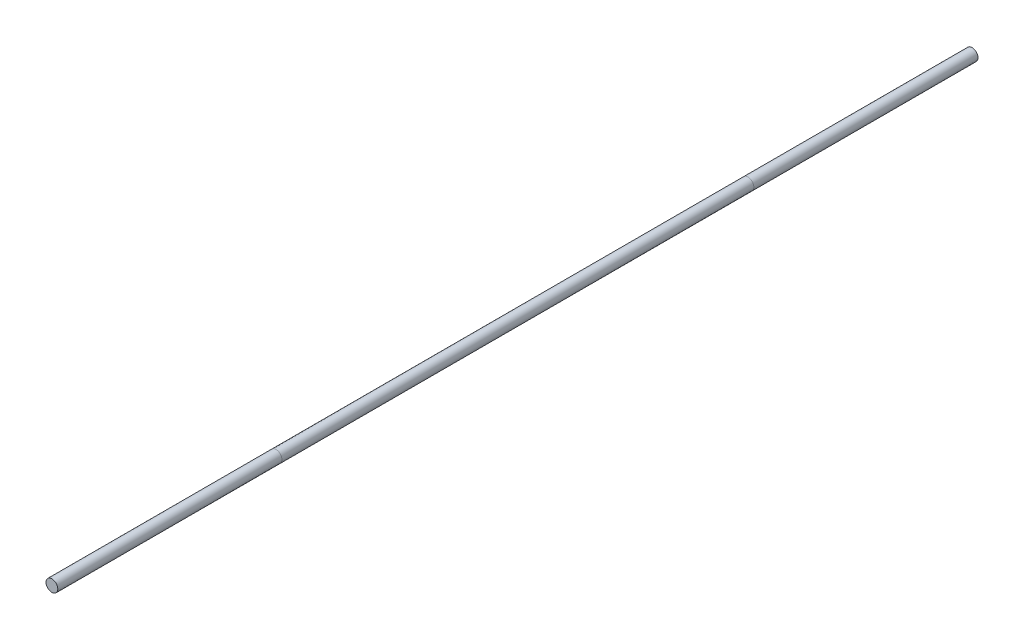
from build123d import *

# Parameters (mm, degrees)
SKETCH1_R          = 3.175
BASE_EXTRUDE_DEPTH = 247.65


with BuildPart() as part:
    # Sketch1 → Base-Extrude (new, symmetric)
    with BuildSketch(Plane.XY):
        Circle(SKETCH1_R)
    extrude(amount=BASE_EXTRUDE_DEPTH, both=True)


solid = part.part
